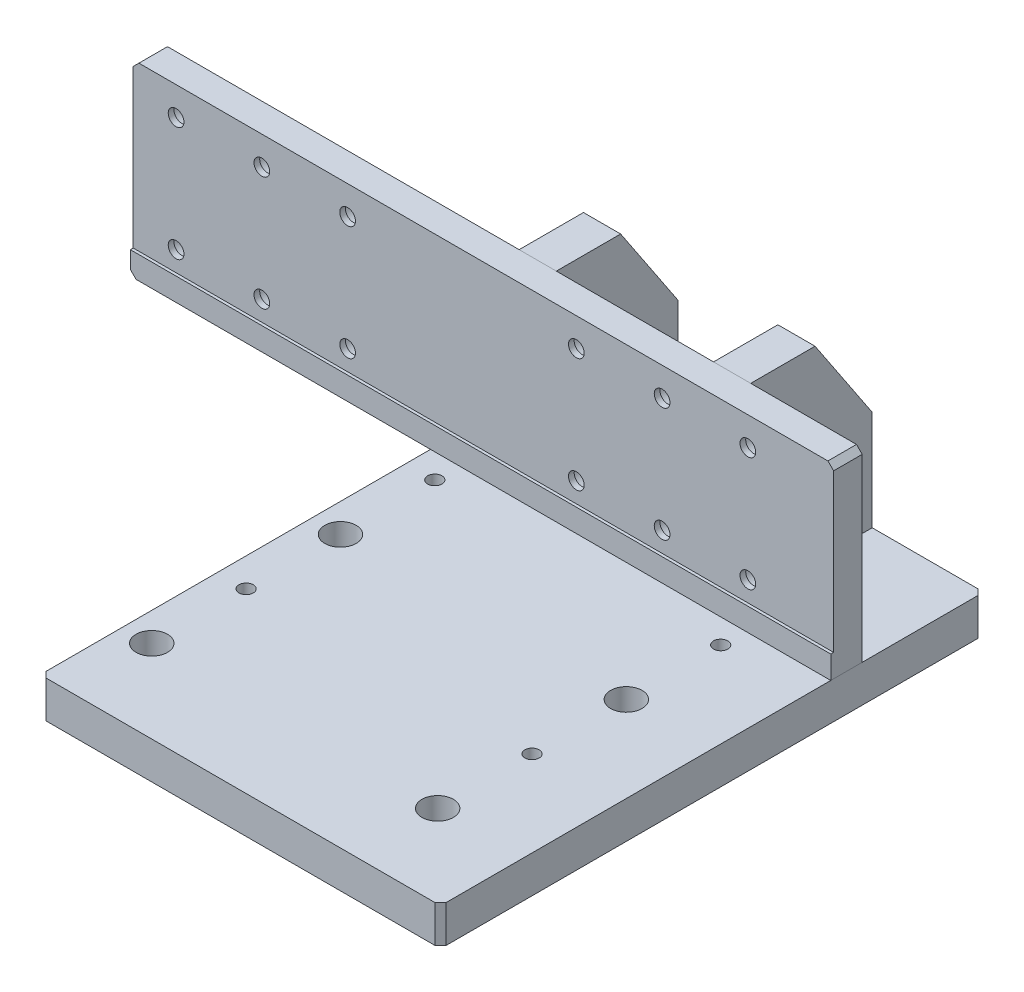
from build123d import *

# Parameters (mm, degrees)
SKETCH_1_W                  = 140
SKETCH_1_H                  = 190
EXTRUDE_1_DEPTH             = 13
SKETCH_2_W                  = 245
SKETCH_2_H                  = 11
EXTRUDE_2_DEPTH             = 65
SKETCH_3_W                  = 245
SKETCH_3_H                  = 57
CUT_EXTRUDE_1_DEPTH         = 1
SKETCH_4_W                  = 13
SKETCH_4_H                  = 42.5
EXTRUDE_3_DEPTH             = 65
EXTRUDE_3_2_DEPTH           = 65
CUT_EXTRUDE_2_DEPTH         = 176.311151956
HOLE_WIZARD_M6_1_AT_2_COUNT = 2
HOLE_WIZARD_M6_1_AT_2_PITCH = 100
HOLE_WIZARD_M6_1_AT_3_COUNT = 2
HOLE_WIZARD_M6_1_AT_3_PITCH = 119.816526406
HOLE_WIZARD_M6_1_AT_4_COUNT = 2
HOLE_WIZARD_M6_1_AT_4_PITCH = 66
HOLE_WIZARD_M6_1_AT_5_COUNT = 2
HOLE_WIZARD_M6_1_AT_5_PITCH = 132
HOLE_WIZARD_M6_1_AT_6_COUNT = 2
HOLE_WIZARD_M6_1_AT_6_PITCH = 165.601932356
SKETCH_9_W                  = 2.5
SKETCH_9_H                  = 13
F_5_0MM_1_AT_2_COUNT        = 2
F_5_0MM_1_AT_2_PITCH        = 100
F_5_0MM_1_AT_3_COUNT        = 2
F_5_0MM_1_AT_3_PITCH        = 66
F_5_0MM_1_AT_4_COUNT        = 2
F_5_0MM_1_AT_4_PITCH        = 119.816526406
HOLE_WIZARD_M5_1_AT_2_COUNT = 2
HOLE_WIZARD_M5_1_AT_2_PITCH = 30
HOLE_WIZARD_M5_1_AT_3_COUNT = 2
HOLE_WIZARD_M5_1_AT_3_PITCH = 60
HOLE_WIZARD_M5_1_AT_4_COUNT = 2
HOLE_WIZARD_M5_1_AT_4_PITCH = 40
HOLE_WIZARD_M5_1_AT_5_COUNT = 2
HOLE_WIZARD_M5_1_AT_5_PITCH = 50
HOLE_WIZARD_M5_1_AT_6_COUNT = 2
HOLE_WIZARD_M5_1_AT_6_PITCH = 72.111025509
PATTERN_LINEAR_1_COUNT      = 2
PATTERN_LINEAR_1_PITCH      = 140
CHAMFER_1_SIZE              = 2
CHAMFER_2_SIZE              = 2


with BuildPart() as part:
    # Sketch 1 → Extrude 1 (new body)
    with BuildSketch(Plane(origin=(0, 0, 0), x_dir=(1, 0, 0), z_dir=(0, 1, 0))):
        Rectangle(SKETCH_1_W, SKETCH_1_H)
    extrude(amount=EXTRUDE_1_DEPTH)

    # Sketch 7 → Hole Wizard M6 _ _ _ _ _1 (revolve, cut)
    with BuildSketch(Plane(origin=(-60, 13, -66), x_dir=(0, 0, 1), z_dir=(1, 0, 0))):
        Polygon((0, 0), (0, 13), (3.3, 13), (3.3, 8), (5.5, 8), (5.5, 0), align=None)
    hole_wizard_m6_1 = revolve(axis=Axis((-60, 19.35, -66), (0, -1, 0)), mode=Mode.SUBTRACT)

    # Hole Wizard M6 _ _ _ _ _1 at 2: Hole Wizard M6 _ _ _ _ _1 ×2
    with Locations(*[(i * HOLE_WIZARD_M6_1_AT_2_PITCH, 0, 0) for i in range(1, HOLE_WIZARD_M6_1_AT_2_COUNT)]):
        add(hole_wizard_m6_1, mode=Mode.SUBTRACT)

    # Hole Wizard M6 _ _ _ _ _1 at 3: Hole Wizard M6 _ _ _ _ _1 ×2
    with Locations(*[Vector(0.8346094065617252, 0, 0.5508422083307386) * (i * HOLE_WIZARD_M6_1_AT_3_PITCH) for i in range(1, HOLE_WIZARD_M6_1_AT_3_COUNT)]):
        add(hole_wizard_m6_1, mode=Mode.SUBTRACT)

    # Hole Wizard M6 _ _ _ _ _1 at 4: Hole Wizard M6 _ _ _ _ _1 ×2
    with Locations(*[(0, 0, i * HOLE_WIZARD_M6_1_AT_4_PITCH) for i in range(1, HOLE_WIZARD_M6_1_AT_4_COUNT)]):
        add(hole_wizard_m6_1, mode=Mode.SUBTRACT)

    # Hole Wizard M6 _ _ _ _ _1 at 5: Hole Wizard M6 _ _ _ _ _1 ×2
    with Locations(*[(0, 0, i * HOLE_WIZARD_M6_1_AT_5_PITCH) for i in range(1, HOLE_WIZARD_M6_1_AT_5_COUNT)]):
        add(hole_wizard_m6_1, mode=Mode.SUBTRACT)

    # Hole Wizard M6 _ _ _ _ _1 at 6: Hole Wizard M6 _ _ _ _ _1 ×2
    with Locations(*[Vector(0.6038576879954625, 0, 0.7970921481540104) * (i * HOLE_WIZARD_M6_1_AT_6_PITCH) for i in range(1, HOLE_WIZARD_M6_1_AT_6_COUNT)]):
        add(hole_wizard_m6_1, mode=Mode.SUBTRACT)

    # Sketch 9 → 5.0mm _ _1 (revolve, cut)
    with BuildSketch(Plane(origin=(-60, 13, -33), x_dir=(0, 0, 1), z_dir=(1, 0, 0))):
        with Locations((1.25, 6.5)):
            Rectangle(SKETCH_9_W, SKETCH_9_H)
    f_5_0mm_1 = revolve(axis=Axis((-60, 19.35, -33), (0, -1, 0)), mode=Mode.SUBTRACT)

    # 5.0mm _ _1 at 2: 5.0mm _ _1 ×2
    with Locations(*[(i * F_5_0MM_1_AT_2_PITCH, 0, 0) for i in range(1, F_5_0MM_1_AT_2_COUNT)]):
        add(f_5_0mm_1, mode=Mode.SUBTRACT)

    # 5.0mm _ _1 at 3: 5.0mm _ _1 ×2
    with Locations(*[(0, 0, i * F_5_0MM_1_AT_3_PITCH) for i in range(1, F_5_0MM_1_AT_3_COUNT)]):
        add(f_5_0mm_1, mode=Mode.SUBTRACT)

    # 5.0mm _ _1 at 4: 5.0mm _ _1 ×2
    with Locations(*[Vector(0.8346094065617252, 0, 0.5508422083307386) * (i * F_5_0MM_1_AT_4_PITCH) for i in range(1, F_5_0MM_1_AT_4_COUNT)]):
        add(f_5_0mm_1, mode=Mode.SUBTRACT)

    # Chamfer 2
    chamfer_2_edges = [part.edges().sort_by_distance(p)[0] for p in [
        (70, 6.5, 95),
        (-70, 6.5, 95),
        (-70, 6.5, -95),
        (70, 6.5, -95),
    ]]
    chamfer(chamfer_2_edges, length=CHAMFER_2_SIZE)


with BuildPart() as body_2:
    # Sketch 2 → Extrude 2 (new body)
    with BuildSketch(Plane(origin=(0, 13, 0), x_dir=(1, 0, 0), z_dir=(0, 1, 0))):
        with Locations((-52.5, 47)):
            Rectangle(SKETCH_2_W, SKETCH_2_H)
    extrude(amount=EXTRUDE_2_DEPTH)

    # Sketch 3 → Cut-Extrude 1 (cut)
    with BuildSketch(Plane.XY.offset(-41.5)):
        with Locations((-52.5, 49.5)):
            Rectangle(SKETCH_3_W, SKETCH_3_H)
    extrude(amount=-CUT_EXTRUDE_1_DEPTH, mode=Mode.SUBTRACT)

    # Sketch 11 → Hole Wizard M5 _ _ _ _ _1 (revolve, cut)
    with BuildSketch(Plane(origin=(40, 68, -52.5), x_dir=(0, 1, 0), z_dir=(1, 0, 0))):
        Polygon((0, 0), (0, 147.5), (2.75, 147.5), (2.75, 8), (4.75, 8), (4.75, 0), align=None)
    hole_wizard_m5_1 = revolve(axis=Axis((40, 68, -58.85), (0, 0, 1)), mode=Mode.SUBTRACT)

    # Hole Wizard M5 _ _ _ _ _1 at 2: Hole Wizard M5 _ _ _ _ _1 ×2
    with Locations(*[(-i * HOLE_WIZARD_M5_1_AT_2_PITCH, 0, 0) for i in range(1, HOLE_WIZARD_M5_1_AT_2_COUNT)]):
        add(hole_wizard_m5_1, mode=Mode.SUBTRACT)

    # Hole Wizard M5 _ _ _ _ _1 at 3: Hole Wizard M5 _ _ _ _ _1 ×2
    with Locations(*[(-i * HOLE_WIZARD_M5_1_AT_3_PITCH, 0, 0) for i in range(1, HOLE_WIZARD_M5_1_AT_3_COUNT)]):
        add(hole_wizard_m5_1, mode=Mode.SUBTRACT)

    # Hole Wizard M5 _ _ _ _ _1 at 4: Hole Wizard M5 _ _ _ _ _1 ×2
    with Locations(*[(0, -i * HOLE_WIZARD_M5_1_AT_4_PITCH, 0) for i in range(1, HOLE_WIZARD_M5_1_AT_4_COUNT)]):
        add(hole_wizard_m5_1, mode=Mode.SUBTRACT)

    # Hole Wizard M5 _ _ _ _ _1 at 5: Hole Wizard M5 _ _ _ _ _1 ×2
    with Locations(*[Vector(-0.6, -0.8, 0) * (i * HOLE_WIZARD_M5_1_AT_5_PITCH) for i in range(1, HOLE_WIZARD_M5_1_AT_5_COUNT)]):
        add(hole_wizard_m5_1, mode=Mode.SUBTRACT)

    # Hole Wizard M5 _ _ _ _ _1 at 6: Hole Wizard M5 _ _ _ _ _1 ×2
    with Locations(*[Vector(-0.8320502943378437, -0.5547001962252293, 0) * (i * HOLE_WIZARD_M5_1_AT_6_PITCH) for i in range(1, HOLE_WIZARD_M5_1_AT_6_COUNT)]):
        add(hole_wizard_m5_1, mode=Mode.SUBTRACT)

    # Pattern Linear 1: Hole Wizard M5 _ _ _ _ _1 ×2
    with Locations(*[(-i * PATTERN_LINEAR_1_PITCH, 0, 0) for i in range(1, PATTERN_LINEAR_1_COUNT)]):
        add(hole_wizard_m5_1, mode=Mode.SUBTRACT)

    # Pattern Linear 1 copy 1 sketch → Pattern Linear 1 copy 1 (revolve, cut)
    with BuildSketch(Plane(origin=(-130, 68, -52.5), x_dir=(0, 1, 0), z_dir=(1, 0, 0))):
        Polygon((0, 0), (0, 147.5), (2.75, 147.5), (2.75, 8), (4.75, 8), (4.75, 0), align=None)
    revolve(axis=Axis((-130, 68, -58.85), (0, 0, 1)), mode=Mode.SUBTRACT)

    # Pattern Linear 1 copy 2 sketch → Pattern Linear 1 copy 2 (revolve, cut)
    with BuildSketch(Plane(origin=(-160, 68, -52.5), x_dir=(0, 1, 0), z_dir=(1, 0, 0))):
        Polygon((0, 0), (0, 147.5), (2.75, 147.5), (2.75, 8), (4.75, 8), (4.75, 0), align=None)
    revolve(axis=Axis((-160, 68, -58.85), (0, 0, 1)), mode=Mode.SUBTRACT)

    # Pattern Linear 1 copy 3 sketch → Pattern Linear 1 copy 3 (revolve, cut)
    with BuildSketch(Plane(origin=(-100, 28, -52.5), x_dir=(0, 1, 0), z_dir=(1, 0, 0))):
        Polygon((0, 0), (0, 147.5), (2.75, 147.5), (2.75, 8), (4.75, 8), (4.75, 0), align=None)
    revolve(axis=Axis((-100, 28, -58.85), (0, 0, 1)), mode=Mode.SUBTRACT)

    # Pattern Linear 1 copy 4 sketch → Pattern Linear 1 copy 4 (revolve, cut)
    with BuildSketch(Plane(origin=(-130, 28, -52.5), x_dir=(0, 1, 0), z_dir=(1, 0, 0))):
        Polygon((0, 0), (0, 147.5), (2.75, 147.5), (2.75, 8), (4.75, 8), (4.75, 0), align=None)
    revolve(axis=Axis((-130, 28, -58.85), (0, 0, 1)), mode=Mode.SUBTRACT)

    # Pattern Linear 1 copy 5 sketch → Pattern Linear 1 copy 5 (revolve, cut)
    with BuildSketch(Plane(origin=(-160, 28, -52.5), x_dir=(0, 1, 0), z_dir=(1, 0, 0))):
        Polygon((0, 0), (0, 147.5), (2.75, 147.5), (2.75, 8), (4.75, 8), (4.75, 0), align=None)
    revolve(axis=Axis((-160, 28, -58.85), (0, 0, 1)), mode=Mode.SUBTRACT)

    # Chamfer 1
    chamfer_1_edges = [body_2.edges().sort_by_distance(p)[0] for p in [
        (-175, 78, -47.5),
        (70, 78, -47.5),
        (-175, 13, -47),
    ]]
    chamfer(chamfer_1_edges, length=CHAMFER_1_SIZE)


with BuildPart() as body_3:
    # Sketch 4 → Extrude 3 (new body)
    with BuildSketch(Plane(origin=(0, 13, 0), x_dir=(1, 0, 0), z_dir=(0, 1, 0))):
        with Locations((-43.5, 73.75)):
            Rectangle(SKETCH_4_W, SKETCH_4_H)
    extrude(amount=EXTRUDE_3_DEPTH)


with BuildPart() as body_4:
    # Sketch 4 → Extrude 3 2 (new body)
    with BuildSketch(Plane(origin=(0, 13, 0), x_dir=(1, 0, 0), z_dir=(0, 1, 0))):
        with Locations((24.5, 73.75)):
            Rectangle(SKETCH_4_W, SKETCH_4_H)
    extrude(amount=EXTRUDE_3_2_DEPTH)


with BuildPart() as cut_extrude_2_tool:
    # Sketch 5 → Cut-Extrude 2 (new, through all)
    with BuildSketch(Plane.ZY.offset(50)):
        Polygon((-95, 78), (-95, 48), (-75, 78), align=None)
    extrude(amount=-CUT_EXTRUDE_2_DEPTH)


with BuildPart() as body_3_1:
    add(body_3.part)

    # Cut-Extrude 2: cut by cut_extrude_2_tool
    add(cut_extrude_2_tool.part, mode=Mode.SUBTRACT)


with BuildPart() as body_4_1:
    add(body_4.part)

    # Cut-Extrude 2: cut by cut_extrude_2_tool
    add(cut_extrude_2_tool.part, mode=Mode.SUBTRACT)


solid = Compound([part.part, body_2.part, body_3_1.part, body_4_1.part])
